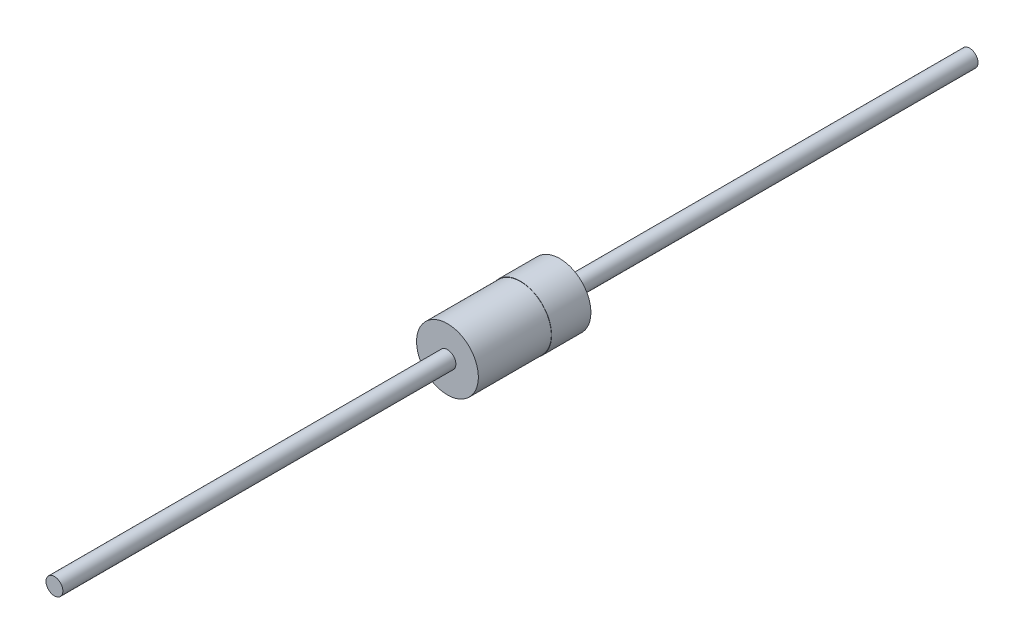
ISO-10303-21;
HEADER;
FILE_DESCRIPTION(('STEP AP214'),'2;1');
FILE_NAME('part.step','',(''),(''),'','','');
FILE_SCHEMA(('AUTOMOTIVE_DESIGN { 1 0 10303 214 1 1 1 1 }'));
ENDSEC;
DATA;
#1=APPLICATION_CONTEXT('core data for automotive mechanical design processes');
#2=APPLICATION_PROTOCOL_DEFINITION('international standard','automotive_design',2000,#1);
#3=PRODUCT_CONTEXT('',#1,'mechanical');
#4=PRODUCT('Part','Part','',(#3));
#5=PRODUCT_RELATED_PRODUCT_CATEGORY('part','',(#4));
#6=PRODUCT_DEFINITION_FORMATION('','',#4);
#7=PRODUCT_DEFINITION_CONTEXT('part definition',#1,'design');
#8=PRODUCT_DEFINITION('design','',#6,#7);
#9=PRODUCT_DEFINITION_SHAPE('','',#8);
#10=(LENGTH_UNIT() NAMED_UNIT(*) SI_UNIT(.MILLI.,.METRE.));
#11=(NAMED_UNIT(*) PLANE_ANGLE_UNIT() SI_UNIT($,.RADIAN.));
#12=(NAMED_UNIT(*) SI_UNIT($,.STERADIAN.) SOLID_ANGLE_UNIT());
#13=UNCERTAINTY_MEASURE_WITH_UNIT(LENGTH_MEASURE(1.E-05),#10,'distance_accuracy_value','');
#14=(GEOMETRIC_REPRESENTATION_CONTEXT(3) GLOBAL_UNCERTAINTY_ASSIGNED_CONTEXT((#13)) GLOBAL_UNIT_ASSIGNED_CONTEXT((#10,
#11,#12)) REPRESENTATION_CONTEXT('',''));
#15=CARTESIAN_POINT('',(0.,0.,0.));
#16=DIRECTION('',(0.,0.,1.));
#17=DIRECTION('',(1.,0.,0.));
#18=AXIS2_PLACEMENT_3D('',#15,#16,#17);
#19=CARTESIAN_POINT('',(0.,0.,3.302));
#20=DIRECTION('',(0.,0.,0.999999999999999));
#21=DIRECTION('',(1.,0.,0.));
#22=AXIS2_PLACEMENT_3D('',#19,#20,#21);
#23=PLANE('',#22);
#24=CARTESIAN_POINT('',(0.,0.,3.302));
#25=DIRECTION('',(0.,0.,0.999999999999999));
#26=DIRECTION('',(1.,0.,0.));
#27=AXIS2_PLACEMENT_3D('',#24,#25,#26);
#28=CIRCLE('',#27,1.397);
#29=CARTESIAN_POINT('',(-1.397,0.,3.302));
#30=VERTEX_POINT('',#29);
#31=EDGE_CURVE('E10',#30,#30,#28,.T.);
#32=ORIENTED_EDGE('',*,*,#31,.T.);
#33=EDGE_LOOP('',(#32));
#34=FACE_BOUND('',#33,.T.);
#35=CARTESIAN_POINT('',(0.,0.,3.302));
#36=DIRECTION('',(0.,0.,0.999999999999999));
#37=DIRECTION('',(1.,0.,0.));
#38=AXIS2_PLACEMENT_3D('',#35,#36,#37);
#39=CIRCLE('',#38,0.381);
#40=CARTESIAN_POINT('',(-0.381,0.,3.302));
#41=VERTEX_POINT('',#40);
#42=EDGE_CURVE('E34',#41,#41,#39,.F.);
#43=ORIENTED_EDGE('',*,*,#42,.T.);
#44=EDGE_LOOP('',(#43));
#45=FACE_BOUND('',#44,.T.);
#46=ADVANCED_FACE('F26',(#34,#45),#23,.T.);
#47=CARTESIAN_POINT('',(0.,0.,3.302));
#48=DIRECTION('',(0.,0.,-0.999999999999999));
#49=DIRECTION('',(-1.,0.,0.));
#50=AXIS2_PLACEMENT_3D('',#47,#48,#49);
#51=CYLINDRICAL_SURFACE('',#50,1.397);
#52=CARTESIAN_POINT('',(0.,0.,0.));
#53=DIRECTION('',(0.,0.,-0.999999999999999));
#54=DIRECTION('',(-1.,0.,0.));
#55=AXIS2_PLACEMENT_3D('',#52,#53,#54);
#56=CIRCLE('',#55,1.397);
#57=CARTESIAN_POINT('',(-1.397,0.,0.));
#58=VERTEX_POINT('',#57);
#59=EDGE_CURVE('E46',#58,#58,#56,.T.);
#60=CARTESIAN_POINT('',(-1.397,0.,3.302));
#61=CARTESIAN_POINT('',(-1.397,0.,3.26760416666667));
#62=CARTESIAN_POINT('',(-1.397,0.,3.23320833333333));
#63=CARTESIAN_POINT('',(-1.397,0.,3.16441666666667));
#64=CARTESIAN_POINT('',(-1.397,0.,3.13002083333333));
#65=CARTESIAN_POINT('',(-1.397,0.,3.06122916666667));
#66=CARTESIAN_POINT('',(-1.397,0.,3.02683333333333));
#67=CARTESIAN_POINT('',(-1.397,0.,2.95804166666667));
#68=CARTESIAN_POINT('',(-1.397,0.,2.92364583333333));
#69=CARTESIAN_POINT('',(-1.397,0.,2.85485416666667));
#70=CARTESIAN_POINT('',(-1.397,0.,2.82045833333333));
#71=CARTESIAN_POINT('',(-1.397,0.,2.75166666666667));
#72=CARTESIAN_POINT('',(-1.397,0.,2.71727083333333));
#73=CARTESIAN_POINT('',(-1.397,0.,2.64847916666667));
#74=CARTESIAN_POINT('',(-1.397,0.,2.61408333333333));
#75=CARTESIAN_POINT('',(-1.397,0.,2.54529166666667));
#76=CARTESIAN_POINT('',(-1.397,0.,2.51089583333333));
#77=CARTESIAN_POINT('',(-1.397,0.,2.44210416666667));
#78=CARTESIAN_POINT('',(-1.397,0.,2.40770833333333));
#79=CARTESIAN_POINT('',(-1.397,0.,2.33891666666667));
#80=CARTESIAN_POINT('',(-1.397,0.,2.30452083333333));
#81=CARTESIAN_POINT('',(-1.397,0.,2.23572916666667));
#82=CARTESIAN_POINT('',(-1.397,0.,2.20133333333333));
#83=CARTESIAN_POINT('',(-1.397,0.,2.13254166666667));
#84=CARTESIAN_POINT('',(-1.397,0.,2.09814583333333));
#85=CARTESIAN_POINT('',(-1.397,0.,2.02935416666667));
#86=CARTESIAN_POINT('',(-1.397,0.,1.99495833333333));
#87=CARTESIAN_POINT('',(-1.397,0.,1.92616666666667));
#88=CARTESIAN_POINT('',(-1.397,0.,1.89177083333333));
#89=CARTESIAN_POINT('',(-1.397,0.,1.82297916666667));
#90=CARTESIAN_POINT('',(-1.397,0.,1.78858333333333));
#91=CARTESIAN_POINT('',(-1.397,0.,1.71979166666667));
#92=CARTESIAN_POINT('',(-1.397,0.,1.68539583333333));
#93=CARTESIAN_POINT('',(-1.397,0.,1.61660416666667));
#94=CARTESIAN_POINT('',(-1.397,0.,1.58220833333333));
#95=CARTESIAN_POINT('',(-1.397,0.,1.51341666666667));
#96=CARTESIAN_POINT('',(-1.397,0.,1.47902083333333));
#97=CARTESIAN_POINT('',(-1.397,0.,1.41022916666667));
#98=CARTESIAN_POINT('',(-1.397,0.,1.37583333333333));
#99=CARTESIAN_POINT('',(-1.397,0.,1.30704166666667));
#100=CARTESIAN_POINT('',(-1.397,0.,1.27264583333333));
#101=CARTESIAN_POINT('',(-1.397,0.,1.20385416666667));
#102=CARTESIAN_POINT('',(-1.397,0.,1.16945833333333));
#103=CARTESIAN_POINT('',(-1.397,0.,1.10066666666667));
#104=CARTESIAN_POINT('',(-1.397,0.,1.06627083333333));
#105=CARTESIAN_POINT('',(-1.397,0.,0.997479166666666));
#106=CARTESIAN_POINT('',(-1.397,0.,0.963083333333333));
#107=CARTESIAN_POINT('',(-1.397,0.,0.894291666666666));
#108=CARTESIAN_POINT('',(-1.397,0.,0.859895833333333));
#109=CARTESIAN_POINT('',(-1.397,0.,0.791104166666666));
#110=CARTESIAN_POINT('',(-1.397,0.,0.756708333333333));
#111=CARTESIAN_POINT('',(-1.397,0.,0.687916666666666));
#112=CARTESIAN_POINT('',(-1.397,0.,0.653520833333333));
#113=CARTESIAN_POINT('',(-1.397,0.,0.584729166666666));
#114=CARTESIAN_POINT('',(-1.397,0.,0.550333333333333));
#115=CARTESIAN_POINT('',(-1.397,0.,0.481541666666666));
#116=CARTESIAN_POINT('',(-1.397,0.,0.447145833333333));
#117=CARTESIAN_POINT('',(-1.397,0.,0.378354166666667));
#118=CARTESIAN_POINT('',(-1.397,0.,0.343958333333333));
#119=CARTESIAN_POINT('',(-1.397,0.,0.275166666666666));
#120=CARTESIAN_POINT('',(-1.397,0.,0.240770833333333));
#121=CARTESIAN_POINT('',(-1.397,0.,0.171979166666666));
#122=CARTESIAN_POINT('',(-1.397,0.,0.137583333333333));
#123=CARTESIAN_POINT('',(-1.397,0.,0.0687916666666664));
#124=CARTESIAN_POINT('',(-1.397,0.,0.0343958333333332));
#125=CARTESIAN_POINT('',(-1.397,0.,0.));
#126=B_SPLINE_CURVE_WITH_KNOTS('',3,(#60,#61,#62,#63,#64,#65,#66,#67,#68,#69,#70,#71,#72,#73,
#74,#75,#76,#77,#78,#79,#80,#81,#82,#83,#84,#85,#86,#87,#88,#89,#90,#91,#92,#93,#94,#95,#96,#97,
#98,#99,#100,#101,#102,#103,#104,#105,#106,#107,#108,#109,#110,#111,#112,#113,#114,#115,#116,
#117,#118,#119,#120,#121,#122,#123,#124,#125),.UNSPECIFIED.,.F.,.F.,(4,2,2,2,2,2,2,2,2,2,2,2,2,
2,2,2,2,2,2,2,2,2,2,2,2,2,2,2,2,2,2,2,4),(0.,0.1031875,0.206375,0.3095625,0.41275,
0.515937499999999,0.619124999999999,0.722312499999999,0.825499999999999,0.928687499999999,
1.031875,1.1350625,1.23825,1.3414375,1.444625,1.5478125,1.651,1.7541875,1.857375,1.9605625,
2.06375,2.1669375,2.270125,2.3733125,2.4765,2.5796875,2.682875,2.7860625,2.88925,2.9924375,
3.095625,3.1988125,3.302),.UNSPECIFIED.);
#127=EDGE_CURVE('BSEAM28',#30,#58,#126,.T.);
#128=ORIENTED_EDGE('',*,*,#31,.F.);
#129=ORIENTED_EDGE('',*,*,#59,.F.);
#130=ORIENTED_EDGE('',*,*,#127,.T.);
#131=ORIENTED_EDGE('',*,*,#127,.F.);
#132=EDGE_LOOP('',(#128,#130,#129,#131));
#133=FACE_BOUND('',#132,.T.);
#134=ADVANCED_FACE('F28',(#133),#51,.T.);
#135=CARTESIAN_POINT('',(0.,0.,21.082));
#136=DIRECTION('',(0.,0.,-0.999999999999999));
#137=DIRECTION('',(-1.,0.,0.));
#138=AXIS2_PLACEMENT_3D('',#135,#136,#137);
#139=CYLINDRICAL_SURFACE('',#138,0.381);
#140=CARTESIAN_POINT('',(0.,0.,21.082));
#141=DIRECTION('',(0.,0.,0.999999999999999));
#142=DIRECTION('',(1.,0.,0.));
#143=AXIS2_PLACEMENT_3D('',#140,#141,#142);
#144=CIRCLE('',#143,0.381);
#145=CARTESIAN_POINT('',(-0.381,0.,21.082));
#146=VERTEX_POINT('',#145);
#147=EDGE_CURVE('E38',#146,#146,#144,.T.);
#148=CARTESIAN_POINT('',(-0.381,0.,3.302));
#149=CARTESIAN_POINT('',(-0.381,0.,3.48720833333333));
#150=CARTESIAN_POINT('',(-0.381,0.,3.67241666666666));
#151=CARTESIAN_POINT('',(-0.381,0.,4.04283333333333));
#152=CARTESIAN_POINT('',(-0.381,0.,4.22804166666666));
#153=CARTESIAN_POINT('',(-0.381,0.,4.59845833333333));
#154=CARTESIAN_POINT('',(-0.381,0.,4.78366666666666));
#155=CARTESIAN_POINT('',(-0.381,0.,5.15408333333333));
#156=CARTESIAN_POINT('',(-0.381,0.,5.33929166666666));
#157=CARTESIAN_POINT('',(-0.381,0.,5.70970833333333));
#158=CARTESIAN_POINT('',(-0.381,0.,5.89491666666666));
#159=CARTESIAN_POINT('',(-0.381,0.,6.26533333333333));
#160=CARTESIAN_POINT('',(-0.381,0.,6.45054166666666));
#161=CARTESIAN_POINT('',(-0.381,0.,6.82095833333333));
#162=CARTESIAN_POINT('',(-0.381,0.,7.00616666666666));
#163=CARTESIAN_POINT('',(-0.381,0.,7.37658333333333));
#164=CARTESIAN_POINT('',(-0.381,0.,7.56179166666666));
#165=CARTESIAN_POINT('',(-0.381,0.,7.93220833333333));
#166=CARTESIAN_POINT('',(-0.381,0.,8.11741666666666));
#167=CARTESIAN_POINT('',(-0.381,0.,8.48783333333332));
#168=CARTESIAN_POINT('',(-0.381,0.,8.67304166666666));
#169=CARTESIAN_POINT('',(-0.381,0.,9.04345833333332));
#170=CARTESIAN_POINT('',(-0.381,0.,9.22866666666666));
#171=CARTESIAN_POINT('',(-0.381,0.,9.59908333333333));
#172=CARTESIAN_POINT('',(-0.381,0.,9.78429166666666));
#173=CARTESIAN_POINT('',(-0.381,0.,10.1547083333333));
#174=CARTESIAN_POINT('',(-0.381,0.,10.3399166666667));
#175=CARTESIAN_POINT('',(-0.381,0.,10.7103333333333));
#176=CARTESIAN_POINT('',(-0.381,0.,10.8955416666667));
#177=CARTESIAN_POINT('',(-0.381,0.,11.2659583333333));
#178=CARTESIAN_POINT('',(-0.381,0.,11.4511666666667));
#179=CARTESIAN_POINT('',(-0.381,0.,11.8215833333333));
#180=CARTESIAN_POINT('',(-0.381,0.,12.0067916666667));
#181=CARTESIAN_POINT('',(-0.381,0.,12.3772083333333));
#182=CARTESIAN_POINT('',(-0.381,0.,12.5624166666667));
#183=CARTESIAN_POINT('',(-0.381,0.,12.9328333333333));
#184=CARTESIAN_POINT('',(-0.381,0.,13.1180416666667));
#185=CARTESIAN_POINT('',(-0.381,0.,13.4884583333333));
#186=CARTESIAN_POINT('',(-0.381,0.,13.6736666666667));
#187=CARTESIAN_POINT('',(-0.381,0.,14.0440833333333));
#188=CARTESIAN_POINT('',(-0.381,0.,14.2292916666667));
#189=CARTESIAN_POINT('',(-0.381,0.,14.5997083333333));
#190=CARTESIAN_POINT('',(-0.381,0.,14.7849166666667));
#191=CARTESIAN_POINT('',(-0.381,0.,15.1553333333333));
#192=CARTESIAN_POINT('',(-0.381,0.,15.3405416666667));
#193=CARTESIAN_POINT('',(-0.381,0.,15.7109583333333));
#194=CARTESIAN_POINT('',(-0.381,0.,15.8961666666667));
#195=CARTESIAN_POINT('',(-0.381,0.,16.2665833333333));
#196=CARTESIAN_POINT('',(-0.381,0.,16.4517916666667));
#197=CARTESIAN_POINT('',(-0.381,0.,16.8222083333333));
#198=CARTESIAN_POINT('',(-0.381,0.,17.0074166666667));
#199=CARTESIAN_POINT('',(-0.381,0.,17.3778333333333));
#200=CARTESIAN_POINT('',(-0.381,0.,17.5630416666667));
#201=CARTESIAN_POINT('',(-0.381,0.,17.9334583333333));
#202=CARTESIAN_POINT('',(-0.381,0.,18.1186666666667));
#203=CARTESIAN_POINT('',(-0.381,0.,18.4890833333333));
#204=CARTESIAN_POINT('',(-0.381,0.,18.6742916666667));
#205=CARTESIAN_POINT('',(-0.381,0.,19.0447083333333));
#206=CARTESIAN_POINT('',(-0.381,0.,19.2299166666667));
#207=CARTESIAN_POINT('',(-0.381,0.,19.6003333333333));
#208=CARTESIAN_POINT('',(-0.381,0.,19.7855416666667));
#209=CARTESIAN_POINT('',(-0.381,0.,20.1559583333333));
#210=CARTESIAN_POINT('',(-0.381,0.,20.3411666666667));
#211=CARTESIAN_POINT('',(-0.381,0.,20.7115833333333));
#212=CARTESIAN_POINT('',(-0.381,0.,20.8967916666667));
#213=CARTESIAN_POINT('',(-0.381,0.,21.082));
#214=B_SPLINE_CURVE_WITH_KNOTS('',3,(#148,#149,#150,#151,#152,#153,#154,#155,#156,#157,#158,
#159,#160,#161,#162,#163,#164,#165,#166,#167,#168,#169,#170,#171,#172,#173,#174,#175,#176,#177,
#178,#179,#180,#181,#182,#183,#184,#185,#186,#187,#188,#189,#190,#191,#192,#193,#194,#195,#196,
#197,#198,#199,#200,#201,#202,#203,#204,#205,#206,#207,#208,#209,#210,#211,#212,#213),
.UNSPECIFIED.,.F.,.F.,(4,2,2,2,2,2,2,2,2,2,2,2,2,2,2,2,2,2,2,2,2,2,2,2,2,2,2,2,2,2,2,2,4),(0.,
0.555624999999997,1.11125,1.666875,2.2225,2.778125,3.33375,3.889375,4.445,5.000625,5.55625,
6.111875,6.6675,7.223125,7.77875,8.33437499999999,8.89,9.44562499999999,10.00125,10.556875,
11.1125,11.668125,12.22375,12.779375,13.335,13.890625,14.44625,15.001875,15.5575,16.113125,
16.66875,17.224375,17.78),.UNSPECIFIED.);
#215=EDGE_CURVE('BSEAM66',#41,#146,#214,.T.);
#216=ORIENTED_EDGE('',*,*,#42,.F.);
#217=ORIENTED_EDGE('',*,*,#147,.F.);
#218=ORIENTED_EDGE('',*,*,#215,.T.);
#219=ORIENTED_EDGE('',*,*,#215,.F.);
#220=EDGE_LOOP('',(#216,#218,#217,#219));
#221=FACE_BOUND('',#220,.T.);
#222=ADVANCED_FACE('F66',(#221),#139,.T.);
#223=CARTESIAN_POINT('',(0.,0.,21.082));
#224=DIRECTION('',(0.,0.,0.999999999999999));
#225=DIRECTION('',(1.,0.,0.));
#226=AXIS2_PLACEMENT_3D('',#223,#224,#225);
#227=PLANE('',#226);
#228=ORIENTED_EDGE('',*,*,#147,.T.);
#229=EDGE_LOOP('',(#228));
#230=FACE_BOUND('',#229,.T.);
#231=ADVANCED_FACE('F72',(#230),#227,.T.);
#232=CARTESIAN_POINT('',(0.,0.,-1.778));
#233=DIRECTION('',(0.,0.,-0.999999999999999));
#234=DIRECTION('',(-1.,0.,0.));
#235=AXIS2_PLACEMENT_3D('',#232,#233,#234);
#236=PLANE('',#235);
#237=CARTESIAN_POINT('',(0.,0.,-1.778));
#238=DIRECTION('',(0.,0.,-0.999999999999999));
#239=DIRECTION('',(-1.,0.,0.));
#240=AXIS2_PLACEMENT_3D('',#237,#238,#239);
#241=CIRCLE('',#240,1.4097);
#242=CARTESIAN_POINT('',(1.4097,0.,-1.778));
#243=VERTEX_POINT('',#242);
#244=EDGE_CURVE('E49',#243,#243,#241,.T.);
#245=ORIENTED_EDGE('',*,*,#244,.T.);
#246=EDGE_LOOP('',(#245));
#247=FACE_BOUND('',#246,.T.);
#248=CARTESIAN_POINT('',(0.,0.,-1.778));
#249=DIRECTION('',(0.,0.,-0.999999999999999));
#250=DIRECTION('',(-1.,0.,0.));
#251=AXIS2_PLACEMENT_3D('',#248,#249,#250);
#252=CIRCLE('',#251,0.381);
#253=CARTESIAN_POINT('',(-0.381,0.,-1.778));
#254=VERTEX_POINT('',#253);
#255=EDGE_CURVE('E30',#254,#254,#252,.T.);
#256=ORIENTED_EDGE('',*,*,#255,.F.);
#257=EDGE_LOOP('',(#256));
#258=FACE_BOUND('',#257,.T.);
#259=ADVANCED_FACE('F61',(#247,#258),#236,.T.);
#260=CARTESIAN_POINT('',(0.,0.,0.));
#261=DIRECTION('',(0.,0.,-0.999999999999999));
#262=DIRECTION('',(-1.,0.,0.));
#263=AXIS2_PLACEMENT_3D('',#260,#261,#262);
#264=PLANE('',#263);
#265=CARTESIAN_POINT('',(0.,0.,0.));
#266=DIRECTION('',(0.,0.,-0.999999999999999));
#267=DIRECTION('',(-1.,0.,0.));
#268=AXIS2_PLACEMENT_3D('',#265,#266,#267);
#269=CIRCLE('',#268,1.4097);
#270=CARTESIAN_POINT('',(1.4097,0.,0.));
#271=VERTEX_POINT('',#270);
#272=EDGE_CURVE('E52',#271,#271,#269,.T.);
#273=ORIENTED_EDGE('',*,*,#272,.F.);
#274=EDGE_LOOP('',(#273));
#275=FACE_BOUND('',#274,.T.);
#276=ORIENTED_EDGE('',*,*,#59,.T.);
#277=EDGE_LOOP('',(#276));
#278=FACE_BOUND('',#277,.T.);
#279=ADVANCED_FACE('F58',(#275,#278),#264,.F.);
#280=CARTESIAN_POINT('',(0.,0.,-1.778));
#281=DIRECTION('',(0.,0.,0.999999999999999));
#282=DIRECTION('',(1.,0.,0.));
#283=AXIS2_PLACEMENT_3D('',#280,#281,#282);
#284=CYLINDRICAL_SURFACE('',#283,1.4097);
#285=CARTESIAN_POINT('',(1.4097,0.,-1.778));
#286=CARTESIAN_POINT('',(1.4097,0.,-1.75947916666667));
#287=CARTESIAN_POINT('',(1.4097,0.,-1.74095833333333));
#288=CARTESIAN_POINT('',(1.4097,0.,-1.70391666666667));
#289=CARTESIAN_POINT('',(1.4097,0.,-1.68539583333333));
#290=CARTESIAN_POINT('',(1.4097,0.,-1.64835416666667));
#291=CARTESIAN_POINT('',(1.4097,0.,-1.62983333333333));
#292=CARTESIAN_POINT('',(1.4097,0.,-1.59279166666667));
#293=CARTESIAN_POINT('',(1.4097,0.,-1.57427083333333));
#294=CARTESIAN_POINT('',(1.4097,0.,-1.53722916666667));
#295=CARTESIAN_POINT('',(1.4097,0.,-1.51870833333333));
#296=CARTESIAN_POINT('',(1.4097,0.,-1.48166666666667));
#297=CARTESIAN_POINT('',(1.4097,0.,-1.46314583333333));
#298=CARTESIAN_POINT('',(1.4097,0.,-1.42610416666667));
#299=CARTESIAN_POINT('',(1.4097,0.,-1.40758333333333));
#300=CARTESIAN_POINT('',(1.4097,0.,-1.37054166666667));
#301=CARTESIAN_POINT('',(1.4097,0.,-1.35202083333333));
#302=CARTESIAN_POINT('',(1.4097,0.,-1.31497916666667));
#303=CARTESIAN_POINT('',(1.4097,0.,-1.29645833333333));
#304=CARTESIAN_POINT('',(1.4097,0.,-1.25941666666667));
#305=CARTESIAN_POINT('',(1.4097,0.,-1.24089583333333));
#306=CARTESIAN_POINT('',(1.4097,0.,-1.20385416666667));
#307=CARTESIAN_POINT('',(1.4097,0.,-1.18533333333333));
#308=CARTESIAN_POINT('',(1.4097,0.,-1.14829166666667));
#309=CARTESIAN_POINT('',(1.4097,0.,-1.12977083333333));
#310=CARTESIAN_POINT('',(1.4097,0.,-1.09272916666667));
#311=CARTESIAN_POINT('',(1.4097,0.,-1.07420833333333));
#312=CARTESIAN_POINT('',(1.4097,0.,-1.03716666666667));
#313=CARTESIAN_POINT('',(1.4097,0.,-1.01864583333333));
#314=CARTESIAN_POINT('',(1.4097,0.,-0.981604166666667));
#315=CARTESIAN_POINT('',(1.4097,0.,-0.963083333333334));
#316=CARTESIAN_POINT('',(1.4097,0.,-0.926041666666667));
#317=CARTESIAN_POINT('',(1.4097,0.,-0.907520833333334));
#318=CARTESIAN_POINT('',(1.4097,0.,-0.870479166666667));
#319=CARTESIAN_POINT('',(1.4097,0.,-0.851958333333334));
#320=CARTESIAN_POINT('',(1.4097,0.,-0.814916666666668));
#321=CARTESIAN_POINT('',(1.4097,0.,-0.796395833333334));
#322=CARTESIAN_POINT('',(1.4097,0.,-0.759354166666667));
#323=CARTESIAN_POINT('',(1.4097,0.,-0.740833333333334));
#324=CARTESIAN_POINT('',(1.4097,0.,-0.703791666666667));
#325=CARTESIAN_POINT('',(1.4097,0.,-0.685270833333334));
#326=CARTESIAN_POINT('',(1.4097,0.,-0.648229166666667));
#327=CARTESIAN_POINT('',(1.4097,0.,-0.629708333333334));
#328=CARTESIAN_POINT('',(1.4097,0.,-0.592666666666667));
#329=CARTESIAN_POINT('',(1.4097,0.,-0.574145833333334));
#330=CARTESIAN_POINT('',(1.4097,0.,-0.537104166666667));
#331=CARTESIAN_POINT('',(1.4097,0.,-0.518583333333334));
#332=CARTESIAN_POINT('',(1.4097,0.,-0.481541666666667));
#333=CARTESIAN_POINT('',(1.4097,0.,-0.463020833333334));
#334=CARTESIAN_POINT('',(1.4097,0.,-0.425979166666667));
#335=CARTESIAN_POINT('',(1.4097,0.,-0.407458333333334));
#336=CARTESIAN_POINT('',(1.4097,0.,-0.370416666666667));
#337=CARTESIAN_POINT('',(1.4097,0.,-0.351895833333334));
#338=CARTESIAN_POINT('',(1.4097,0.,-0.314854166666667));
#339=CARTESIAN_POINT('',(1.4097,0.,-0.296333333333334));
#340=CARTESIAN_POINT('',(1.4097,0.,-0.259291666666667));
#341=CARTESIAN_POINT('',(1.4097,0.,-0.240770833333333));
#342=CARTESIAN_POINT('',(1.4097,0.,-0.203729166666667));
#343=CARTESIAN_POINT('',(1.4097,0.,-0.185208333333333));
#344=CARTESIAN_POINT('',(1.4097,0.,-0.148166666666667));
#345=CARTESIAN_POINT('',(1.4097,0.,-0.129645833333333));
#346=CARTESIAN_POINT('',(1.4097,0.,-0.0926041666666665));
#347=CARTESIAN_POINT('',(1.4097,0.,-0.0740833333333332));
#348=CARTESIAN_POINT('',(1.4097,0.,-0.0370416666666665));
#349=CARTESIAN_POINT('',(1.4097,0.,-0.0185208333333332));
#350=CARTESIAN_POINT('',(1.4097,0.,0.));
#351=B_SPLINE_CURVE_WITH_KNOTS('',3,(#285,#286,#287,#288,#289,#290,#291,#292,#293,#294,#295,
#296,#297,#298,#299,#300,#301,#302,#303,#304,#305,#306,#307,#308,#309,#310,#311,#312,#313,#314,
#315,#316,#317,#318,#319,#320,#321,#322,#323,#324,#325,#326,#327,#328,#329,#330,#331,#332,#333,
#334,#335,#336,#337,#338,#339,#340,#341,#342,#343,#344,#345,#346,#347,#348,#349,#350),
.UNSPECIFIED.,.F.,.F.,(4,2,2,2,2,2,2,2,2,2,2,2,2,2,2,2,2,2,2,2,2,2,2,2,2,2,2,2,2,2,2,2,4),(0.,
0.0555625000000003,0.111125,0.1666875,0.22225,0.2778125,0.333375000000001,0.388937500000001,
0.444500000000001,0.500062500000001,0.555625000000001,0.611187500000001,0.666750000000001,
0.722312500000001,0.777875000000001,0.833437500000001,0.889000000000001,0.944562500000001,
1.000125,1.0556875,1.11125,1.1668125,1.222375,1.2779375,1.3335,1.3890625,1.444625,1.5001875,
1.55575,1.6113125,1.666875,1.7224375,1.778),.UNSPECIFIED.);
#352=EDGE_CURVE('BSEAM56',#243,#271,#351,.T.);
#353=ORIENTED_EDGE('',*,*,#244,.F.);
#354=ORIENTED_EDGE('',*,*,#272,.T.);
#355=ORIENTED_EDGE('',*,*,#352,.T.);
#356=ORIENTED_EDGE('',*,*,#352,.F.);
#357=EDGE_LOOP('',(#353,#355,#354,#356));
#358=FACE_BOUND('',#357,.T.);
#359=ADVANCED_FACE('F56',(#358),#284,.T.);
#360=CARTESIAN_POINT('',(0.,0.,-20.32));
#361=DIRECTION('',(0.,0.,-0.999999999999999));
#362=DIRECTION('',(-1.,0.,0.));
#363=AXIS2_PLACEMENT_3D('',#360,#361,#362);
#364=PLANE('',#363);
#365=CARTESIAN_POINT('',(0.,0.,-20.32));
#366=DIRECTION('',(0.,0.,-0.999999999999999));
#367=DIRECTION('',(-1.,0.,0.));
#368=AXIS2_PLACEMENT_3D('',#365,#366,#367);
#369=CIRCLE('',#368,0.381);
#370=CARTESIAN_POINT('',(-0.381,0.,-20.32));
#371=VERTEX_POINT('',#370);
#372=EDGE_CURVE('E43',#371,#371,#369,.T.);
#373=ORIENTED_EDGE('',*,*,#372,.T.);
#374=EDGE_LOOP('',(#373));
#375=FACE_BOUND('',#374,.T.);
#376=ADVANCED_FACE('F83',(#375),#364,.T.);
#377=CARTESIAN_POINT('',(-0.381,0.,-1.778));
#378=CARTESIAN_POINT('',(-0.381,0.,-1.97114583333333));
#379=CARTESIAN_POINT('',(-0.381,0.,-2.16429166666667));
#380=CARTESIAN_POINT('',(-0.381,0.,-2.55058333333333));
#381=CARTESIAN_POINT('',(-0.381,0.,-2.74372916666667));
#382=CARTESIAN_POINT('',(-0.381,0.,-3.13002083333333));
#383=CARTESIAN_POINT('',(-0.381,0.,-3.32316666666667));
#384=CARTESIAN_POINT('',(-0.381,0.,-3.70945833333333));
#385=CARTESIAN_POINT('',(-0.381,0.,-3.90260416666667));
#386=CARTESIAN_POINT('',(-0.381,0.,-4.28889583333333));
#387=CARTESIAN_POINT('',(-0.381,0.,-4.48204166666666));
#388=CARTESIAN_POINT('',(-0.381,0.,-4.86833333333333));
#389=CARTESIAN_POINT('',(-0.381,0.,-5.06147916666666));
#390=CARTESIAN_POINT('',(-0.381,0.,-5.44777083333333));
#391=CARTESIAN_POINT('',(-0.381,0.,-5.64091666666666));
#392=CARTESIAN_POINT('',(-0.381,0.,-6.02720833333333));
#393=CARTESIAN_POINT('',(-0.381,0.,-6.22035416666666));
#394=CARTESIAN_POINT('',(-0.381,0.,-6.60664583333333));
#395=CARTESIAN_POINT('',(-0.381,0.,-6.79979166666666));
#396=CARTESIAN_POINT('',(-0.381,0.,-7.18608333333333));
#397=CARTESIAN_POINT('',(-0.381,0.,-7.37922916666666));
#398=CARTESIAN_POINT('',(-0.381,0.,-7.76552083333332));
#399=CARTESIAN_POINT('',(-0.381,0.,-7.95866666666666));
#400=CARTESIAN_POINT('',(-0.381,0.,-8.34495833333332));
#401=CARTESIAN_POINT('',(-0.381,0.,-8.53810416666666));
#402=CARTESIAN_POINT('',(-0.381,0.,-8.92439583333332));
#403=CARTESIAN_POINT('',(-0.381,0.,-9.11754166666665));
#404=CARTESIAN_POINT('',(-0.381,0.,-9.50383333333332));
#405=CARTESIAN_POINT('',(-0.381,0.,-9.69697916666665));
#406=CARTESIAN_POINT('',(-0.381,0.,-10.0832708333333));
#407=CARTESIAN_POINT('',(-0.381,0.,-10.2764166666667));
#408=CARTESIAN_POINT('',(-0.381,0.,-10.6627083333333));
#409=CARTESIAN_POINT('',(-0.381,0.,-10.8558541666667));
#410=CARTESIAN_POINT('',(-0.381,0.,-11.2421458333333));
#411=CARTESIAN_POINT('',(-0.381,0.,-11.4352916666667));
#412=CARTESIAN_POINT('',(-0.381,0.,-11.8215833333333));
#413=CARTESIAN_POINT('',(-0.381,0.,-12.0147291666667));
#414=CARTESIAN_POINT('',(-0.381,0.,-12.4010208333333));
#415=CARTESIAN_POINT('',(-0.381,0.,-12.5941666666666));
#416=CARTESIAN_POINT('',(-0.381,0.,-12.9804583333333));
#417=CARTESIAN_POINT('',(-0.381,0.,-13.1736041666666));
#418=CARTESIAN_POINT('',(-0.381,0.,-13.5598958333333));
#419=CARTESIAN_POINT('',(-0.381,0.,-13.7530416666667));
#420=CARTESIAN_POINT('',(-0.381,0.,-14.1393333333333));
#421=CARTESIAN_POINT('',(-0.381,0.,-14.3324791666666));
#422=CARTESIAN_POINT('',(-0.381,0.,-14.7187708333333));
#423=CARTESIAN_POINT('',(-0.381,0.,-14.9119166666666));
#424=CARTESIAN_POINT('',(-0.381,0.,-15.2982083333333));
#425=CARTESIAN_POINT('',(-0.381,0.,-15.4913541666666));
#426=CARTESIAN_POINT('',(-0.381,0.,-15.8776458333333));
#427=CARTESIAN_POINT('',(-0.381,0.,-16.0707916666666));
#428=CARTESIAN_POINT('',(-0.381,0.,-16.4570833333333));
#429=CARTESIAN_POINT('',(-0.381,0.,-16.6502291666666));
#430=CARTESIAN_POINT('',(-0.381,0.,-17.0365208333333));
#431=CARTESIAN_POINT('',(-0.381,0.,-17.2296666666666));
#432=CARTESIAN_POINT('',(-0.381,0.,-17.6159583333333));
#433=CARTESIAN_POINT('',(-0.381,0.,-17.8091041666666));
#434=CARTESIAN_POINT('',(-0.381,0.,-18.1953958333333));
#435=CARTESIAN_POINT('',(-0.381,0.,-18.3885416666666));
#436=CARTESIAN_POINT('',(-0.381,0.,-18.7748333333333));
#437=CARTESIAN_POINT('',(-0.381,0.,-18.9679791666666));
#438=CARTESIAN_POINT('',(-0.381,0.,-19.3542708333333));
#439=CARTESIAN_POINT('',(-0.381,0.,-19.5474166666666));
#440=CARTESIAN_POINT('',(-0.381,0.,-19.9337083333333));
#441=CARTESIAN_POINT('',(-0.381,0.,-20.1268541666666));
#442=CARTESIAN_POINT('',(-0.381,0.,-20.32));
#443=B_SPLINE_CURVE_WITH_KNOTS('',3,(#377,#378,#379,#380,#381,#382,#383,#384,#385,#386,#387,
#388,#389,#390,#391,#392,#393,#394,#395,#396,#397,#398,#399,#400,#401,#402,#403,#404,#405,#406,
#407,#408,#409,#410,#411,#412,#413,#414,#415,#416,#417,#418,#419,#420,#421,#422,#423,#424,#425,
#426,#427,#428,#429,#430,#431,#432,#433,#434,#435,#436,#437,#438,#439,#440,#441,#442),
.UNSPECIFIED.,.F.,.F.,(4,2,2,2,2,2,2,2,2,2,2,2,2,2,2,2,2,2,2,2,2,2,2,2,2,2,2,2,2,2,2,2,4),(0.,
0.579437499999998,1.158875,1.7383125,2.31775,2.89718749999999,3.47662499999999,4.05606249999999,
4.63549999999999,5.21493749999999,5.79437499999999,6.37381249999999,6.95324999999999,
7.53268749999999,8.11212499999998,8.69156249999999,9.27099999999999,9.85043749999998,10.429875,
11.0093125,11.58875,12.1681875,12.747625,13.3270625,13.9065,14.4859375,15.065375,15.6448125,
16.22425,16.8036875,17.383125,17.9625625,18.542),.UNSPECIFIED.);
#444=EDGE_CURVE('BSEAM75',#254,#371,#443,.T.);
#445=ORIENTED_EDGE('',*,*,#255,.T.);
#446=ORIENTED_EDGE('',*,*,#372,.F.);
#447=ORIENTED_EDGE('',*,*,#444,.T.);
#448=ORIENTED_EDGE('',*,*,#444,.F.);
#449=EDGE_LOOP('',(#445,#447,#446,#448));
#450=FACE_BOUND('',#449,.T.);
#451=ADVANCED_FACE('F75',(#450),#139,.T.);
#452=CLOSED_SHELL('',(#46,#134,#222,#231,#259,#279,#359,#376,#451));
#453=MANIFOLD_SOLID_BREP('B2',#452);
#454=ADVANCED_BREP_SHAPE_REPRESENTATION('',(#18,#453),#14);
#455=SHAPE_DEFINITION_REPRESENTATION(#9,#454);
ENDSEC;
END-ISO-10303-21;
